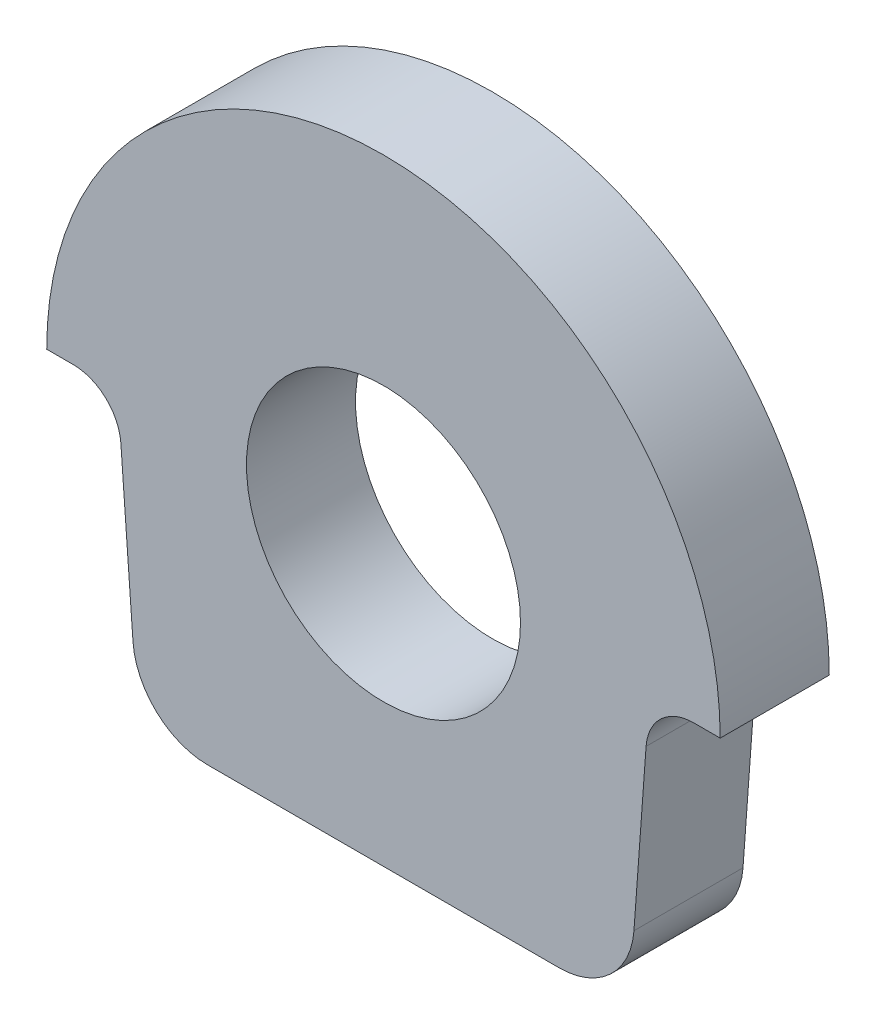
ISO-10303-21;
HEADER;
FILE_DESCRIPTION(('STEP AP214'),'2;1');
FILE_NAME('part.step','',(''),(''),'','','');
FILE_SCHEMA(('AUTOMOTIVE_DESIGN { 1 0 10303 214 1 1 1 1 }'));
ENDSEC;
DATA;
#1=APPLICATION_CONTEXT('core data for automotive mechanical design processes');
#2=APPLICATION_PROTOCOL_DEFINITION('international standard','automotive_design',2000,#1);
#3=PRODUCT_CONTEXT('',#1,'mechanical');
#4=PRODUCT('Part','Part','',(#3));
#5=PRODUCT_RELATED_PRODUCT_CATEGORY('part','',(#4));
#6=PRODUCT_DEFINITION_FORMATION('','',#4);
#7=PRODUCT_DEFINITION_CONTEXT('part definition',#1,'design');
#8=PRODUCT_DEFINITION('design','',#6,#7);
#9=PRODUCT_DEFINITION_SHAPE('','',#8);
#10=(LENGTH_UNIT() NAMED_UNIT(*) SI_UNIT(.MILLI.,.METRE.));
#11=(NAMED_UNIT(*) PLANE_ANGLE_UNIT() SI_UNIT($,.RADIAN.));
#12=(NAMED_UNIT(*) SI_UNIT($,.STERADIAN.) SOLID_ANGLE_UNIT());
#13=UNCERTAINTY_MEASURE_WITH_UNIT(LENGTH_MEASURE(1.E-05),#10,'distance_accuracy_value','');
#14=(GEOMETRIC_REPRESENTATION_CONTEXT(3) GLOBAL_UNCERTAINTY_ASSIGNED_CONTEXT((#13)) GLOBAL_UNIT_ASSIGNED_CONTEXT((#10,
#11,#12)) REPRESENTATION_CONTEXT('',''));
#15=CARTESIAN_POINT('',(0.,0.,0.));
#16=DIRECTION('',(0.,0.,1.));
#17=DIRECTION('',(1.,0.,0.));
#18=AXIS2_PLACEMENT_3D('',#15,#16,#17);
#19=CARTESIAN_POINT('',(12.8877352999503,-15.,8.));
#20=DIRECTION('',(0.,0.,-1.));
#21=DIRECTION('',(-1.,0.,0.));
#22=AXIS2_PLACEMENT_3D('',#19,#20,#21);
#23=PLANE('',#22);
#24=CARTESIAN_POINT('',(12.8877352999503,-15.,8.));
#25=DIRECTION('',(0.,0.,1.));
#26=DIRECTION('',(-1.,0.,0.));
#27=AXIS2_PLACEMENT_3D('',#24,#25,#26);
#28=CIRCLE('',#27,5.5);
#29=CARTESIAN_POINT('',(12.8877352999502,-20.5,8.));
#30=VERTEX_POINT('',#29);
#31=CARTESIAN_POINT('',(18.3730707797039,-15.4013660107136,8.));
#32=VERTEX_POINT('',#31);
#33=EDGE_CURVE('E148',#30,#32,#28,.T.);
#34=ORIENTED_EDGE('',*,*,#33,.T.);
#35=DIRECTION('',(0.072975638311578,0.997333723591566,0.));
#36=VECTOR('',#35,1.);
#37=CARTESIAN_POINT('',(18.3730707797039,-15.4013660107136,8.));
#38=LINE('',#37,#36);
#39=CARTESIAN_POINT('',(19.2625913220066,-3.2445852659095,8.));
#40=VERTEX_POINT('',#39);
#41=EDGE_CURVE('E121',#32,#40,#38,.T.);
#42=ORIENTED_EDGE('',*,*,#41,.T.);
#43=CARTESIAN_POINT('',(22.7532593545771,-3.5,8.));
#44=DIRECTION('',(0.,0.,-1.));
#45=DIRECTION('',(1.,0.,0.));
#46=AXIS2_PLACEMENT_3D('',#43,#44,#45);
#47=CIRCLE('',#46,3.5);
#48=CARTESIAN_POINT('',(22.7532593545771,0.,8.));
#49=VERTEX_POINT('',#48);
#50=EDGE_CURVE('E151',#40,#49,#47,.T.);
#51=ORIENTED_EDGE('',*,*,#50,.T.);
#52=DIRECTION('',(1.,0.,0.));
#53=VECTOR('',#52,1.);
#54=CARTESIAN_POINT('',(22.7532593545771,0.,8.));
#55=LINE('',#54,#53);
#56=CARTESIAN_POINT('',(24.7,0.,8.));
#57=VERTEX_POINT('',#56);
#58=EDGE_CURVE('E153',#49,#57,#55,.T.);
#59=ORIENTED_EDGE('',*,*,#58,.T.);
#60=CARTESIAN_POINT('',(0.,0.,8.));
#61=DIRECTION('',(0.,0.,1.));
#62=DIRECTION('',(1.,0.,0.));
#63=AXIS2_PLACEMENT_3D('',#60,#61,#62);
#64=CIRCLE('',#63,24.7);
#65=CARTESIAN_POINT('',(-24.7,0.,8.));
#66=VERTEX_POINT('',#65);
#67=EDGE_CURVE('E155',#57,#66,#64,.T.);
#68=ORIENTED_EDGE('',*,*,#67,.T.);
#69=DIRECTION('',(1.,0.,0.));
#70=VECTOR('',#69,1.);
#71=CARTESIAN_POINT('',(-22.7532593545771,0.,8.));
#72=LINE('',#71,#70);
#73=CARTESIAN_POINT('',(-22.7532593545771,0.,8.));
#74=VERTEX_POINT('',#73);
#75=EDGE_CURVE('E157',#66,#74,#72,.T.);
#76=ORIENTED_EDGE('',*,*,#75,.T.);
#77=CARTESIAN_POINT('',(-22.7532593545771,-3.5,8.));
#78=DIRECTION('',(0.,0.,-1.));
#79=DIRECTION('',(-1.,0.,0.));
#80=AXIS2_PLACEMENT_3D('',#77,#78,#79);
#81=CIRCLE('',#80,3.5);
#82=CARTESIAN_POINT('',(-19.2625913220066,-3.2445852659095,8.));
#83=VERTEX_POINT('',#82);
#84=EDGE_CURVE('E159',#74,#83,#81,.T.);
#85=ORIENTED_EDGE('',*,*,#84,.T.);
#86=DIRECTION('',(0.072975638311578,-0.997333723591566,0.));
#87=VECTOR('',#86,1.);
#88=CARTESIAN_POINT('',(-18.3730707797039,-15.4013660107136,8.));
#89=LINE('',#88,#87);
#90=CARTESIAN_POINT('',(-18.3730707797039,-15.4013660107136,8.));
#91=VERTEX_POINT('',#90);
#92=EDGE_CURVE('E161',#83,#91,#89,.T.);
#93=ORIENTED_EDGE('',*,*,#92,.T.);
#94=CARTESIAN_POINT('',(-12.8877352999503,-15.,8.));
#95=DIRECTION('',(0.,0.,1.));
#96=DIRECTION('',(1.,0.,0.));
#97=AXIS2_PLACEMENT_3D('',#94,#95,#96);
#98=CIRCLE('',#97,5.5);
#99=CARTESIAN_POINT('',(-12.8877352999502,-20.5,8.));
#100=VERTEX_POINT('',#99);
#101=EDGE_CURVE('E50',#91,#100,#98,.T.);
#102=ORIENTED_EDGE('',*,*,#101,.T.);
#103=DIRECTION('',(1.,0.,0.));
#104=VECTOR('',#103,1.);
#105=CARTESIAN_POINT('',(-12.8877352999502,-20.5,8.));
#106=LINE('',#105,#104);
#107=EDGE_CURVE('E45',#100,#30,#106,.T.);
#108=ORIENTED_EDGE('',*,*,#107,.T.);
#109=EDGE_LOOP('',(#34,#42,#51,#59,#68,#76,#85,#93,#102,#108));
#110=FACE_BOUND('',#109,.T.);
#111=CARTESIAN_POINT('',(0.,0.,8.));
#112=DIRECTION('',(0.,0.,1.));
#113=DIRECTION('',(1.,0.,0.));
#114=AXIS2_PLACEMENT_3D('',#111,#112,#113);
#115=CIRCLE('',#114,10.05);
#116=CARTESIAN_POINT('',(10.05,0.,8.));
#117=VERTEX_POINT('',#116);
#118=EDGE_CURVE('E126',#117,#117,#115,.T.);
#119=ORIENTED_EDGE('',*,*,#118,.F.);
#120=EDGE_LOOP('',(#119));
#121=FACE_BOUND('',#120,.T.);
#122=ADVANCED_FACE('F30',(#110,#121),#23,.F.);
#123=CARTESIAN_POINT('',(12.8877352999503,-15.,0.));
#124=DIRECTION('',(0.,0.,-1.));
#125=DIRECTION('',(-1.,0.,0.));
#126=AXIS2_PLACEMENT_3D('',#123,#124,#125);
#127=PLANE('',#126);
#128=CARTESIAN_POINT('',(12.8877352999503,-15.,0.));
#129=DIRECTION('',(0.,0.,1.));
#130=DIRECTION('',(-1.,0.,0.));
#131=AXIS2_PLACEMENT_3D('',#128,#129,#130);
#132=CIRCLE('',#131,5.5);
#133=CARTESIAN_POINT('',(12.8877352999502,-20.5,0.));
#134=VERTEX_POINT('',#133);
#135=CARTESIAN_POINT('',(18.3730707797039,-15.4013660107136,0.));
#136=VERTEX_POINT('',#135);
#137=EDGE_CURVE('E112',#134,#136,#132,.T.);
#138=ORIENTED_EDGE('',*,*,#137,.F.);
#139=DIRECTION('',(1.,0.,0.));
#140=VECTOR('',#139,1.);
#141=CARTESIAN_POINT('',(-12.8877352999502,-20.5,0.));
#142=LINE('',#141,#140);
#143=CARTESIAN_POINT('',(-12.8877352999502,-20.5,0.));
#144=VERTEX_POINT('',#143);
#145=EDGE_CURVE('E146',#144,#134,#142,.T.);
#146=ORIENTED_EDGE('',*,*,#145,.F.);
#147=CARTESIAN_POINT('',(-12.8877352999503,-15.,0.));
#148=DIRECTION('',(0.,0.,1.));
#149=DIRECTION('',(1.,0.,0.));
#150=AXIS2_PLACEMENT_3D('',#147,#148,#149);
#151=CIRCLE('',#150,5.5);
#152=CARTESIAN_POINT('',(-18.3730707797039,-15.4013660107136,0.));
#153=VERTEX_POINT('',#152);
#154=EDGE_CURVE('E144',#153,#144,#151,.T.);
#155=ORIENTED_EDGE('',*,*,#154,.F.);
#156=DIRECTION('',(0.072975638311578,-0.997333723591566,0.));
#157=VECTOR('',#156,1.);
#158=CARTESIAN_POINT('',(-18.3730707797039,-15.4013660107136,0.));
#159=LINE('',#158,#157);
#160=CARTESIAN_POINT('',(-19.2625913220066,-3.2445852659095,0.));
#161=VERTEX_POINT('',#160);
#162=EDGE_CURVE('E142',#161,#153,#159,.T.);
#163=ORIENTED_EDGE('',*,*,#162,.F.);
#164=CARTESIAN_POINT('',(-22.7532593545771,-3.5,0.));
#165=DIRECTION('',(0.,0.,-1.));
#166=DIRECTION('',(-1.,0.,0.));
#167=AXIS2_PLACEMENT_3D('',#164,#165,#166);
#168=CIRCLE('',#167,3.5);
#169=CARTESIAN_POINT('',(-22.7532593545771,0.,0.));
#170=VERTEX_POINT('',#169);
#171=EDGE_CURVE('E140',#170,#161,#168,.T.);
#172=ORIENTED_EDGE('',*,*,#171,.F.);
#173=DIRECTION('',(1.,0.,0.));
#174=VECTOR('',#173,1.);
#175=CARTESIAN_POINT('',(-22.7532593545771,0.,0.));
#176=LINE('',#175,#174);
#177=CARTESIAN_POINT('',(-24.7,0.,0.));
#178=VERTEX_POINT('',#177);
#179=EDGE_CURVE('E138',#178,#170,#176,.T.);
#180=ORIENTED_EDGE('',*,*,#179,.F.);
#181=CARTESIAN_POINT('',(0.,0.,0.));
#182=DIRECTION('',(0.,0.,1.));
#183=DIRECTION('',(1.,0.,0.));
#184=AXIS2_PLACEMENT_3D('',#181,#182,#183);
#185=CIRCLE('',#184,24.7);
#186=CARTESIAN_POINT('',(24.7,0.,0.));
#187=VERTEX_POINT('',#186);
#188=EDGE_CURVE('E136',#187,#178,#185,.T.);
#189=ORIENTED_EDGE('',*,*,#188,.F.);
#190=DIRECTION('',(1.,0.,0.));
#191=VECTOR('',#190,1.);
#192=CARTESIAN_POINT('',(22.7532593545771,0.,0.));
#193=LINE('',#192,#191);
#194=CARTESIAN_POINT('',(22.7532593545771,0.,0.));
#195=VERTEX_POINT('',#194);
#196=EDGE_CURVE('E134',#195,#187,#193,.T.);
#197=ORIENTED_EDGE('',*,*,#196,.F.);
#198=CARTESIAN_POINT('',(22.7532593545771,-3.5,0.));
#199=DIRECTION('',(0.,0.,-1.));
#200=DIRECTION('',(1.,0.,0.));
#201=AXIS2_PLACEMENT_3D('',#198,#199,#200);
#202=CIRCLE('',#201,3.5);
#203=CARTESIAN_POINT('',(19.2625913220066,-3.2445852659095,0.));
#204=VERTEX_POINT('',#203);
#205=EDGE_CURVE('E114',#204,#195,#202,.T.);
#206=ORIENTED_EDGE('',*,*,#205,.F.);
#207=DIRECTION('',(0.072975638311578,0.997333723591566,0.));
#208=VECTOR('',#207,1.);
#209=CARTESIAN_POINT('',(18.3730707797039,-15.4013660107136,0.));
#210=LINE('',#209,#208);
#211=EDGE_CURVE('E107',#136,#204,#210,.T.);
#212=ORIENTED_EDGE('',*,*,#211,.F.);
#213=EDGE_LOOP('',(#138,#146,#155,#163,#172,#180,#189,#197,#206,#212));
#214=FACE_BOUND('',#213,.T.);
#215=CARTESIAN_POINT('',(0.,0.,0.));
#216=DIRECTION('',(0.,0.,1.));
#217=DIRECTION('',(1.,0.,0.));
#218=AXIS2_PLACEMENT_3D('',#215,#216,#217);
#219=CIRCLE('',#218,10.05);
#220=CARTESIAN_POINT('',(10.05,0.,0.));
#221=VERTEX_POINT('',#220);
#222=EDGE_CURVE('E129',#221,#221,#219,.T.);
#223=ORIENTED_EDGE('',*,*,#222,.T.);
#224=EDGE_LOOP('',(#223));
#225=FACE_BOUND('',#224,.T.);
#226=ADVANCED_FACE('F108',(#214,#225),#127,.T.);
#227=CARTESIAN_POINT('',(12.8877352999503,-15.,8.));
#228=DIRECTION('',(0.,0.,-1.));
#229=DIRECTION('',(-1.,0.,0.));
#230=AXIS2_PLACEMENT_3D('',#227,#228,#229);
#231=CYLINDRICAL_SURFACE('',#230,5.5);
#232=ORIENTED_EDGE('',*,*,#137,.T.);
#233=DIRECTION('',(0.,0.,-1.));
#234=VECTOR('',#233,1.);
#235=CARTESIAN_POINT('',(18.3730707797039,-15.4013660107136,8.));
#236=LINE('',#235,#234);
#237=EDGE_CURVE('E11',#32,#136,#236,.T.);
#238=ORIENTED_EDGE('',*,*,#237,.F.);
#239=ORIENTED_EDGE('',*,*,#33,.F.);
#240=DIRECTION('',(0.,0.,-1.));
#241=VECTOR('',#240,1.);
#242=CARTESIAN_POINT('',(12.8877352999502,-20.5,8.));
#243=LINE('',#242,#241);
#244=EDGE_CURVE('E125',#30,#134,#243,.T.);
#245=ORIENTED_EDGE('',*,*,#244,.T.);
#246=EDGE_LOOP('',(#232,#238,#239,#245));
#247=FACE_BOUND('',#246,.T.);
#248=ADVANCED_FACE('F32',(#247),#231,.T.);
#249=CARTESIAN_POINT('',(18.3730707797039,-15.4013660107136,8.));
#250=DIRECTION('',(-0.997333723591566,0.072975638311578,0.));
#251=DIRECTION('',(-0.072975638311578,-0.997333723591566,0.));
#252=AXIS2_PLACEMENT_3D('',#249,#250,#251);
#253=PLANE('',#252);
#254=ORIENTED_EDGE('',*,*,#211,.T.);
#255=DIRECTION('',(0.,0.,-1.));
#256=VECTOR('',#255,1.);
#257=CARTESIAN_POINT('',(19.2625913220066,-3.2445852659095,8.));
#258=LINE('',#257,#256);
#259=EDGE_CURVE('E38',#40,#204,#258,.T.);
#260=ORIENTED_EDGE('',*,*,#259,.F.);
#261=ORIENTED_EDGE('',*,*,#41,.F.);
#262=ORIENTED_EDGE('',*,*,#237,.T.);
#263=EDGE_LOOP('',(#254,#260,#261,#262));
#264=FACE_BOUND('',#263,.T.);
#265=ADVANCED_FACE('F120',(#264),#253,.F.);
#266=CARTESIAN_POINT('',(22.7532593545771,-3.5,8.));
#267=DIRECTION('',(0.,0.,-1.));
#268=DIRECTION('',(-1.,0.,0.));
#269=AXIS2_PLACEMENT_3D('',#266,#267,#268);
#270=CYLINDRICAL_SURFACE('',#269,3.5);
#271=ORIENTED_EDGE('',*,*,#205,.T.);
#272=DIRECTION('',(0.,0.,-1.));
#273=VECTOR('',#272,1.);
#274=CARTESIAN_POINT('',(22.7532593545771,0.,8.));
#275=LINE('',#274,#273);
#276=EDGE_CURVE('E184',#49,#195,#275,.T.);
#277=ORIENTED_EDGE('',*,*,#276,.F.);
#278=ORIENTED_EDGE('',*,*,#50,.F.);
#279=ORIENTED_EDGE('',*,*,#259,.T.);
#280=EDGE_LOOP('',(#271,#277,#278,#279));
#281=FACE_BOUND('',#280,.T.);
#282=ADVANCED_FACE('F188',(#281),#270,.F.);
#283=CARTESIAN_POINT('',(22.7532593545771,0.,8.));
#284=DIRECTION('',(0.,1.,0.));
#285=DIRECTION('',(0.,0.,1.));
#286=AXIS2_PLACEMENT_3D('',#283,#284,#285);
#287=PLANE('',#286);
#288=ORIENTED_EDGE('',*,*,#196,.T.);
#289=DIRECTION('',(0.,0.,-1.));
#290=VECTOR('',#289,1.);
#291=CARTESIAN_POINT('',(24.7,0.,8.));
#292=LINE('',#291,#290);
#293=EDGE_CURVE('E181',#57,#187,#292,.T.);
#294=ORIENTED_EDGE('',*,*,#293,.F.);
#295=ORIENTED_EDGE('',*,*,#58,.F.);
#296=ORIENTED_EDGE('',*,*,#276,.T.);
#297=EDGE_LOOP('',(#288,#294,#295,#296));
#298=FACE_BOUND('',#297,.T.);
#299=ADVANCED_FACE('F196',(#298),#287,.F.);
#300=CARTESIAN_POINT('',(0.,0.,8.));
#301=DIRECTION('',(0.,0.,-1.));
#302=DIRECTION('',(-1.,0.,0.));
#303=AXIS2_PLACEMENT_3D('',#300,#301,#302);
#304=CYLINDRICAL_SURFACE('',#303,24.7);
#305=ORIENTED_EDGE('',*,*,#188,.T.);
#306=DIRECTION('',(0.,0.,-1.));
#307=VECTOR('',#306,1.);
#308=CARTESIAN_POINT('',(-24.7,0.,8.));
#309=LINE('',#308,#307);
#310=EDGE_CURVE('E178',#66,#178,#309,.T.);
#311=ORIENTED_EDGE('',*,*,#310,.F.);
#312=ORIENTED_EDGE('',*,*,#67,.F.);
#313=ORIENTED_EDGE('',*,*,#293,.T.);
#314=EDGE_LOOP('',(#305,#311,#312,#313));
#315=FACE_BOUND('',#314,.T.);
#316=ADVANCED_FACE('F199',(#315),#304,.T.);
#317=CARTESIAN_POINT('',(-22.7532593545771,0.,8.));
#318=DIRECTION('',(0.,1.,0.));
#319=DIRECTION('',(0.,0.,1.));
#320=AXIS2_PLACEMENT_3D('',#317,#318,#319);
#321=PLANE('',#320);
#322=ORIENTED_EDGE('',*,*,#179,.T.);
#323=DIRECTION('',(0.,0.,-1.));
#324=VECTOR('',#323,1.);
#325=CARTESIAN_POINT('',(-22.7532593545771,0.,8.));
#326=LINE('',#325,#324);
#327=EDGE_CURVE('E175',#74,#170,#326,.T.);
#328=ORIENTED_EDGE('',*,*,#327,.F.);
#329=ORIENTED_EDGE('',*,*,#75,.F.);
#330=ORIENTED_EDGE('',*,*,#310,.T.);
#331=EDGE_LOOP('',(#322,#328,#329,#330));
#332=FACE_BOUND('',#331,.T.);
#333=ADVANCED_FACE('F204',(#332),#321,.F.);
#334=CARTESIAN_POINT('',(-22.7532593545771,-3.5,8.));
#335=DIRECTION('',(0.,0.,-1.));
#336=DIRECTION('',(-1.,0.,0.));
#337=AXIS2_PLACEMENT_3D('',#334,#335,#336);
#338=CYLINDRICAL_SURFACE('',#337,3.5);
#339=ORIENTED_EDGE('',*,*,#171,.T.);
#340=DIRECTION('',(0.,0.,-1.));
#341=VECTOR('',#340,1.);
#342=CARTESIAN_POINT('',(-19.2625913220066,-3.2445852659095,8.));
#343=LINE('',#342,#341);
#344=EDGE_CURVE('E172',#83,#161,#343,.T.);
#345=ORIENTED_EDGE('',*,*,#344,.F.);
#346=ORIENTED_EDGE('',*,*,#84,.F.);
#347=ORIENTED_EDGE('',*,*,#327,.T.);
#348=EDGE_LOOP('',(#339,#345,#346,#347));
#349=FACE_BOUND('',#348,.T.);
#350=ADVANCED_FACE('F210',(#349),#338,.F.);
#351=CARTESIAN_POINT('',(-18.3730707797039,-15.4013660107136,8.));
#352=DIRECTION('',(0.997333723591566,0.072975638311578,0.));
#353=DIRECTION('',(-0.072975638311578,0.997333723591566,0.));
#354=AXIS2_PLACEMENT_3D('',#351,#352,#353);
#355=PLANE('',#354);
#356=ORIENTED_EDGE('',*,*,#162,.T.);
#357=DIRECTION('',(0.,0.,-1.));
#358=VECTOR('',#357,1.);
#359=CARTESIAN_POINT('',(-18.3730707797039,-15.4013660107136,8.));
#360=LINE('',#359,#358);
#361=EDGE_CURVE('E169',#91,#153,#360,.T.);
#362=ORIENTED_EDGE('',*,*,#361,.F.);
#363=ORIENTED_EDGE('',*,*,#92,.F.);
#364=ORIENTED_EDGE('',*,*,#344,.T.);
#365=EDGE_LOOP('',(#356,#362,#363,#364));
#366=FACE_BOUND('',#365,.T.);
#367=ADVANCED_FACE('F214',(#366),#355,.F.);
#368=CARTESIAN_POINT('',(-12.8877352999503,-15.,8.));
#369=DIRECTION('',(0.,0.,-1.));
#370=DIRECTION('',(-1.,0.,0.));
#371=AXIS2_PLACEMENT_3D('',#368,#369,#370);
#372=CYLINDRICAL_SURFACE('',#371,5.5);
#373=ORIENTED_EDGE('',*,*,#154,.T.);
#374=DIRECTION('',(0.,0.,-1.));
#375=VECTOR('',#374,1.);
#376=CARTESIAN_POINT('',(-12.8877352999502,-20.5,8.));
#377=LINE('',#376,#375);
#378=EDGE_CURVE('E166',#100,#144,#377,.T.);
#379=ORIENTED_EDGE('',*,*,#378,.F.);
#380=ORIENTED_EDGE('',*,*,#101,.F.);
#381=ORIENTED_EDGE('',*,*,#361,.T.);
#382=EDGE_LOOP('',(#373,#379,#380,#381));
#383=FACE_BOUND('',#382,.T.);
#384=ADVANCED_FACE('F217',(#383),#372,.T.);
#385=CARTESIAN_POINT('',(-12.8877352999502,-20.5,8.));
#386=DIRECTION('',(0.,1.,0.));
#387=DIRECTION('',(0.,0.,1.));
#388=AXIS2_PLACEMENT_3D('',#385,#386,#387);
#389=PLANE('',#388);
#390=ORIENTED_EDGE('',*,*,#145,.T.);
#391=ORIENTED_EDGE('',*,*,#244,.F.);
#392=ORIENTED_EDGE('',*,*,#107,.F.);
#393=ORIENTED_EDGE('',*,*,#378,.T.);
#394=EDGE_LOOP('',(#390,#391,#392,#393));
#395=FACE_BOUND('',#394,.T.);
#396=ADVANCED_FACE('F219',(#395),#389,.F.);
#397=CARTESIAN_POINT('',(0.,0.,8.));
#398=DIRECTION('',(0.,0.,-1.));
#399=DIRECTION('',(-1.,0.,0.));
#400=AXIS2_PLACEMENT_3D('',#397,#398,#399);
#401=CYLINDRICAL_SURFACE('',#400,10.05);
#402=ORIENTED_EDGE('',*,*,#118,.T.);
#403=EDGE_LOOP('',(#402));
#404=FACE_BOUND('',#403,.T.);
#405=ORIENTED_EDGE('',*,*,#222,.F.);
#406=EDGE_LOOP('',(#405));
#407=FACE_BOUND('',#406,.T.);
#408=ADVANCED_FACE('F221',(#404,#407),#401,.F.);
#409=CLOSED_SHELL('',(#122,#226,#248,#265,#282,#299,#316,#333,#350,#367,#384,#396,#408));
#410=MANIFOLD_SOLID_BREP('B2',#409);
#411=ADVANCED_BREP_SHAPE_REPRESENTATION('',(#18,#410),#14);
#412=SHAPE_DEFINITION_REPRESENTATION(#9,#411);
ENDSEC;
END-ISO-10303-21;
